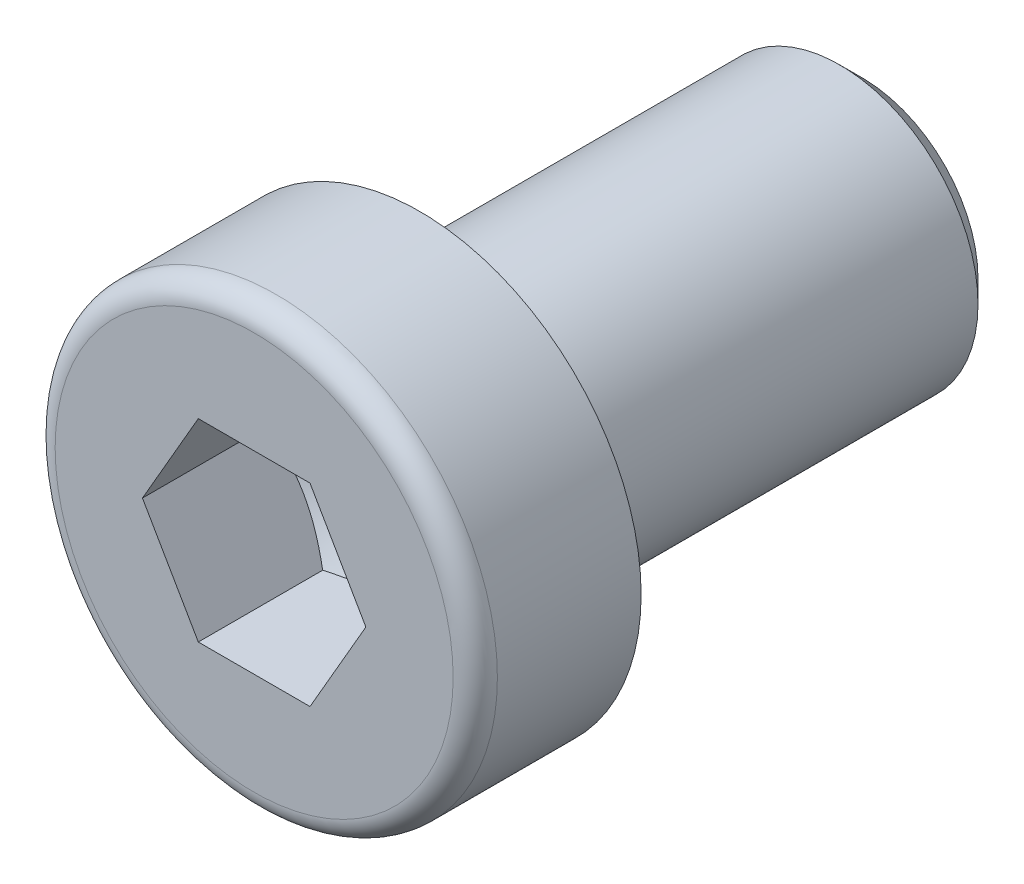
ISO-10303-21;
HEADER;
FILE_DESCRIPTION(('STEP AP214'),'2;1');
FILE_NAME('part.step','',(''),(''),'','','');
FILE_SCHEMA(('AUTOMOTIVE_DESIGN { 1 0 10303 214 1 1 1 1 }'));
ENDSEC;
DATA;
#1=APPLICATION_CONTEXT('core data for automotive mechanical design processes');
#2=APPLICATION_PROTOCOL_DEFINITION('international standard','automotive_design',2000,#1);
#3=PRODUCT_CONTEXT('',#1,'mechanical');
#4=PRODUCT('Part','Part','',(#3));
#5=PRODUCT_RELATED_PRODUCT_CATEGORY('part','',(#4));
#6=PRODUCT_DEFINITION_FORMATION('','',#4);
#7=PRODUCT_DEFINITION_CONTEXT('part definition',#1,'design');
#8=PRODUCT_DEFINITION('design','',#6,#7);
#9=PRODUCT_DEFINITION_SHAPE('','',#8);
#10=(LENGTH_UNIT() NAMED_UNIT(*) SI_UNIT(.MILLI.,.METRE.));
#11=(NAMED_UNIT(*) PLANE_ANGLE_UNIT() SI_UNIT($,.RADIAN.));
#12=(NAMED_UNIT(*) SI_UNIT($,.STERADIAN.) SOLID_ANGLE_UNIT());
#13=UNCERTAINTY_MEASURE_WITH_UNIT(LENGTH_MEASURE(1.E-05),#10,'distance_accuracy_value','');
#14=(GEOMETRIC_REPRESENTATION_CONTEXT(3) GLOBAL_UNCERTAINTY_ASSIGNED_CONTEXT((#13)) GLOBAL_UNIT_ASSIGNED_CONTEXT((#10,
#11,#12)) REPRESENTATION_CONTEXT('',''));
#15=CARTESIAN_POINT('',(0.,0.,0.));
#16=DIRECTION('',(0.,0.,1.));
#17=DIRECTION('',(1.,0.,0.));
#18=AXIS2_PLACEMENT_3D('',#15,#16,#17);
#19=CARTESIAN_POINT('',(0.,0.,6.));
#20=DIRECTION('',(0.,0.,1.));
#21=DIRECTION('',(1.,0.,0.));
#22=AXIS2_PLACEMENT_3D('',#19,#20,#21);
#23=PLANE('',#22);
#24=CARTESIAN_POINT('',(0.,0.,6.));
#25=DIRECTION('',(0.,0.,1.));
#26=DIRECTION('',(1.,0.,0.));
#27=AXIS2_PLACEMENT_3D('',#24,#25,#26);
#28=CIRCLE('',#27,7.2);
#29=CARTESIAN_POINT('',(7.2,0.,6.));
#30=VERTEX_POINT('',#29);
#31=EDGE_CURVE('E9',#30,#30,#28,.T.);
#32=ORIENTED_EDGE('',*,*,#31,.T.);
#33=EDGE_LOOP('',(#32));
#34=FACE_BOUND('',#33,.T.);
#35=DIRECTION('',(1.,0.,0.));
#36=VECTOR('',#35,1.);
#37=CARTESIAN_POINT('',(-2.020725,3.49999836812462,6.));
#38=LINE('',#37,#36);
#39=CARTESIAN_POINT('',(-2.020725,3.49999836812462,6.));
#40=VERTEX_POINT('',#39);
#41=CARTESIAN_POINT('',(2.020725,3.49999836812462,6.));
#42=VERTEX_POINT('',#41);
#43=EDGE_CURVE('E86',#40,#42,#38,.T.);
#44=ORIENTED_EDGE('',*,*,#43,.T.);
#45=DIRECTION('',(0.5,-0.866025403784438,0.));
#46=VECTOR('',#45,1.);
#47=CARTESIAN_POINT('',(2.020725,3.49999836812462,6.));
#48=LINE('',#47,#46);
#49=CARTESIAN_POINT('',(4.04145,0.,6.));
#50=VERTEX_POINT('',#49);
#51=EDGE_CURVE('E26',#42,#50,#48,.T.);
#52=ORIENTED_EDGE('',*,*,#51,.T.);
#53=DIRECTION('',(-0.5,-0.866025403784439,0.));
#54=VECTOR('',#53,1.);
#55=CARTESIAN_POINT('',(4.04145,0.,6.));
#56=LINE('',#55,#54);
#57=CARTESIAN_POINT('',(2.020725,-3.49999836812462,6.));
#58=VERTEX_POINT('',#57);
#59=EDGE_CURVE('E145',#50,#58,#56,.T.);
#60=ORIENTED_EDGE('',*,*,#59,.T.);
#61=DIRECTION('',(-1.,0.,0.));
#62=VECTOR('',#61,1.);
#63=CARTESIAN_POINT('',(2.020725,-3.49999836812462,6.));
#64=LINE('',#63,#62);
#65=CARTESIAN_POINT('',(-2.020725,-3.49999836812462,6.));
#66=VERTEX_POINT('',#65);
#67=EDGE_CURVE('E141',#58,#66,#64,.T.);
#68=ORIENTED_EDGE('',*,*,#67,.T.);
#69=DIRECTION('',(-0.5,0.866025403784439,0.));
#70=VECTOR('',#69,1.);
#71=CARTESIAN_POINT('',(-2.020725,-3.49999836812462,6.));
#72=LINE('',#71,#70);
#73=CARTESIAN_POINT('',(-4.04145,0.,6.));
#74=VERTEX_POINT('',#73);
#75=EDGE_CURVE('E136',#66,#74,#72,.T.);
#76=ORIENTED_EDGE('',*,*,#75,.T.);
#77=DIRECTION('',(0.5,0.866025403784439,0.));
#78=VECTOR('',#77,1.);
#79=CARTESIAN_POINT('',(-4.04145,0.,6.));
#80=LINE('',#79,#78);
#81=EDGE_CURVE('E90',#74,#40,#80,.T.);
#82=ORIENTED_EDGE('',*,*,#81,.T.);
#83=EDGE_LOOP('',(#44,#52,#60,#68,#76,#82));
#84=FACE_BOUND('',#83,.T.);
#85=ADVANCED_FACE('F12',(#34,#84),#23,.T.);
#86=CARTESIAN_POINT('',(0.,0.,5.2));
#87=DIRECTION('',(0.,0.,1.));
#88=DIRECTION('',(1.,0.,0.));
#89=AXIS2_PLACEMENT_3D('',#86,#87,#88);
#90=TOROIDAL_SURFACE('',#89,7.2,0.8);
#91=ORIENTED_EDGE('',*,*,#31,.F.);
#92=EDGE_LOOP('',(#91));
#93=FACE_BOUND('',#92,.T.);
#94=CARTESIAN_POINT('',(0.,0.,5.2));
#95=DIRECTION('',(0.,0.,1.));
#96=DIRECTION('',(1.,0.,0.));
#97=AXIS2_PLACEMENT_3D('',#94,#95,#96);
#98=CIRCLE('',#97,8.);
#99=CARTESIAN_POINT('',(8.,0.,5.2));
#100=VERTEX_POINT('',#99);
#101=EDGE_CURVE('E19',#100,#100,#98,.T.);
#102=ORIENTED_EDGE('',*,*,#101,.T.);
#103=EDGE_LOOP('',(#102));
#104=FACE_BOUND('',#103,.T.);
#105=ADVANCED_FACE('F118',(#93,#104),#90,.T.);
#106=CARTESIAN_POINT('',(0.,0.,6.));
#107=DIRECTION('',(0.,0.,1.));
#108=DIRECTION('',(1.,0.,0.));
#109=AXIS2_PLACEMENT_3D('',#106,#107,#108);
#110=CYLINDRICAL_SURFACE('',#109,8.);
#111=CARTESIAN_POINT('',(0.,0.,0.));
#112=DIRECTION('',(0.,0.,1.));
#113=DIRECTION('',(1.,0.,0.));
#114=AXIS2_PLACEMENT_3D('',#111,#112,#113);
#115=CIRCLE('',#114,8.);
#116=CARTESIAN_POINT('',(8.,0.,0.));
#117=VERTEX_POINT('',#116);
#118=EDGE_CURVE('E113',#117,#117,#115,.T.);
#119=ORIENTED_EDGE('',*,*,#118,.T.);
#120=EDGE_LOOP('',(#119));
#121=FACE_BOUND('',#120,.T.);
#122=ORIENTED_EDGE('',*,*,#101,.F.);
#123=EDGE_LOOP('',(#122));
#124=FACE_BOUND('',#123,.T.);
#125=ADVANCED_FACE('F120',(#121,#124),#110,.T.);
#126=CARTESIAN_POINT('',(0.,8.,0.));
#127=DIRECTION('',(0.,0.,-1.));
#128=DIRECTION('',(-1.,0.,0.));
#129=AXIS2_PLACEMENT_3D('',#126,#127,#128);
#130=PLANE('',#129);
#131=CARTESIAN_POINT('',(0.,0.,0.));
#132=DIRECTION('',(0.,0.,1.));
#133=DIRECTION('',(1.,0.,0.));
#134=AXIS2_PLACEMENT_3D('',#131,#132,#133);
#135=CIRCLE('',#134,5.5);
#136=CARTESIAN_POINT('',(5.5,0.,0.));
#137=VERTEX_POINT('',#136);
#138=EDGE_CURVE('E110',#137,#137,#135,.T.);
#139=ORIENTED_EDGE('',*,*,#138,.T.);
#140=EDGE_LOOP('',(#139));
#141=FACE_BOUND('',#140,.T.);
#142=ORIENTED_EDGE('',*,*,#118,.F.);
#143=EDGE_LOOP('',(#142));
#144=FACE_BOUND('',#143,.T.);
#145=ADVANCED_FACE('F121',(#141,#144),#130,.T.);
#146=CARTESIAN_POINT('',(0.,0.,-0.5));
#147=DIRECTION('',(0.,0.,1.));
#148=DIRECTION('',(1.,0.,0.));
#149=AXIS2_PLACEMENT_3D('',#146,#147,#148);
#150=TOROIDAL_SURFACE('',#149,5.5,0.5);
#151=CARTESIAN_POINT('',(0.,0.,-0.5));
#152=DIRECTION('',(0.,0.,1.));
#153=DIRECTION('',(1.,0.,0.));
#154=AXIS2_PLACEMENT_3D('',#151,#152,#153);
#155=CIRCLE('',#154,5.);
#156=CARTESIAN_POINT('',(5.,0.,-0.5));
#157=VERTEX_POINT('',#156);
#158=EDGE_CURVE('E107',#157,#157,#155,.T.);
#159=ORIENTED_EDGE('',*,*,#158,.T.);
#160=EDGE_LOOP('',(#159));
#161=FACE_BOUND('',#160,.T.);
#162=ORIENTED_EDGE('',*,*,#138,.F.);
#163=EDGE_LOOP('',(#162));
#164=FACE_BOUND('',#163,.T.);
#165=ADVANCED_FACE('F124',(#161,#164),#150,.F.);
#166=CARTESIAN_POINT('',(0.,0.,6.));
#167=DIRECTION('',(0.,0.,1.));
#168=DIRECTION('',(1.,0.,0.));
#169=AXIS2_PLACEMENT_3D('',#166,#167,#168);
#170=CYLINDRICAL_SURFACE('',#169,5.);
#171=CARTESIAN_POINT('',(0.,0.,-15.188125));
#172=DIRECTION('',(0.,0.,1.));
#173=DIRECTION('',(1.,0.,0.));
#174=AXIS2_PLACEMENT_3D('',#171,#172,#173);
#175=CIRCLE('',#174,5.);
#176=CARTESIAN_POINT('',(5.,0.,-15.188125));
#177=VERTEX_POINT('',#176);
#178=EDGE_CURVE('E104',#177,#177,#175,.T.);
#179=ORIENTED_EDGE('',*,*,#178,.T.);
#180=EDGE_LOOP('',(#179));
#181=FACE_BOUND('',#180,.T.);
#182=ORIENTED_EDGE('',*,*,#158,.F.);
#183=EDGE_LOOP('',(#182));
#184=FACE_BOUND('',#183,.T.);
#185=ADVANCED_FACE('F203',(#181,#184),#170,.T.);
#186=CARTESIAN_POINT('',(0.,0.,-15.188125));
#187=DIRECTION('',(0.,0.,1.));
#188=DIRECTION('',(1.,0.,0.));
#189=AXIS2_PLACEMENT_3D('',#186,#187,#188);
#190=CONICAL_SURFACE('',#189,5.,0.785398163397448);
#191=CARTESIAN_POINT('',(0.,0.,-16.));
#192=DIRECTION('',(0.,0.,1.));
#193=DIRECTION('',(1.,0.,0.));
#194=AXIS2_PLACEMENT_3D('',#191,#192,#193);
#195=CIRCLE('',#194,4.188125);
#196=CARTESIAN_POINT('',(4.188125,0.,-16.));
#197=VERTEX_POINT('',#196);
#198=EDGE_CURVE('E101',#197,#197,#195,.T.);
#199=ORIENTED_EDGE('',*,*,#198,.T.);
#200=EDGE_LOOP('',(#199));
#201=FACE_BOUND('',#200,.T.);
#202=ORIENTED_EDGE('',*,*,#178,.F.);
#203=EDGE_LOOP('',(#202));
#204=FACE_BOUND('',#203,.T.);
#205=ADVANCED_FACE('F201',(#201,#204),#190,.T.);
#206=CARTESIAN_POINT('',(0.,4.188125,-16.));
#207=DIRECTION('',(0.,0.,-1.));
#208=DIRECTION('',(-1.,0.,0.));
#209=AXIS2_PLACEMENT_3D('',#206,#207,#208);
#210=PLANE('',#209);
#211=ORIENTED_EDGE('',*,*,#198,.F.);
#212=EDGE_LOOP('',(#211));
#213=FACE_BOUND('',#212,.T.);
#214=ADVANCED_FACE('F196',(#213),#210,.T.);
#215=CARTESIAN_POINT('',(2.020725,3.49999836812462,-0.833332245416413));
#216=DIRECTION('',(-0.866025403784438,-0.5,0.));
#217=DIRECTION('',(-0.5,0.866025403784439,0.));
#218=AXIS2_PLACEMENT_3D('',#215,#216,#217);
#219=PLANE('',#218);
#220=DIRECTION('',(0.,0.,1.));
#221=VECTOR('',#220,1.);
#222=CARTESIAN_POINT('',(4.04145,0.,-0.833332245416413));
#223=LINE('',#222,#221);
#224=CARTESIAN_POINT('',(4.04145,0.,1.5));
#225=VERTEX_POINT('',#224);
#226=EDGE_CURVE('E99',#225,#50,#223,.T.);
#227=ORIENTED_EDGE('',*,*,#226,.T.);
#228=ORIENTED_EDGE('',*,*,#51,.F.);
#229=DIRECTION('',(0.,0.,1.));
#230=VECTOR('',#229,1.);
#231=CARTESIAN_POINT('',(2.020725,3.49999836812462,-0.833332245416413));
#232=LINE('',#231,#230);
#233=CARTESIAN_POINT('',(2.020725,3.49999836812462,1.5));
#234=VERTEX_POINT('',#233);
#235=EDGE_CURVE('E80',#234,#42,#232,.T.);
#236=ORIENTED_EDGE('',*,*,#235,.F.);
#237=CARTESIAN_POINT('',(4.04145011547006,-1.99999999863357E-07,1.50000006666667));
#238=CARTESIAN_POINT('',(3.95265148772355,0.153803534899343,1.44871728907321));
#239=CARTESIAN_POINT('',(3.8630863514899,0.308934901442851,1.40207828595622));
#240=CARTESIAN_POINT('',(3.68240531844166,0.62188363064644,1.32067130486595));
#241=CARTESIAN_POINT('',(3.59128621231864,0.779706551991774,1.28593212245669));
#242=CARTESIAN_POINT('',(3.41017719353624,1.09339657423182,1.23185807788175));
#243=CARTESIAN_POINT('',(3.32021513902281,1.24921542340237,1.21216328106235));
#244=CARTESIAN_POINT('',(3.13986794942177,1.56158591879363,1.18865619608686));
#245=CARTESIAN_POINT('',(3.04948346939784,1.71813643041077,1.18482443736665));
#246=CARTESIAN_POINT('',(2.88060974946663,2.01063429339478,1.19281614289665));
#247=CARTESIAN_POINT('',(2.80209516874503,2.14662553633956,1.20267737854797));
#248=CARTESIAN_POINT('',(2.64557750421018,2.41772208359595,1.23392539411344));
#249=CARTESIAN_POINT('',(2.56757496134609,2.55282645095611,1.25532283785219));
#250=CARTESIAN_POINT('',(2.41073485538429,2.82448148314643,1.3088123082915));
#251=CARTESIAN_POINT('',(2.33191713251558,2.96099778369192,1.34113096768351));
#252=CARTESIAN_POINT('',(2.17545691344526,3.23199483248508,1.41448066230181));
#253=CARTESIAN_POINT('',(2.09781241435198,3.36647904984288,1.45549447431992));
#254=CARTESIAN_POINT('',(2.02072488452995,3.49999856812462,1.50000006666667));
#255=B_SPLINE_CURVE_WITH_KNOTS('',3,(#237,#238,#239,#240,#241,#242,#243,#244,#245,#246,#247,
#248,#249,#250,#251,#252,#253,#254),.UNSPECIFIED.,.F.,.F.,(4,2,2,2,2,2,2,2,4),(0.,
0.55477777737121,1.11088869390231,1.65323758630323,2.19492059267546,2.66648753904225,
3.13849114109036,3.62096152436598,4.10248502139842),.UNSPECIFIED.);
#256=EDGE_CURVE('E73',#225,#234,#255,.T.);
#257=ORIENTED_EDGE('',*,*,#256,.F.);
#258=EDGE_LOOP('',(#227,#228,#236,#257));
#259=FACE_BOUND('',#258,.T.);
#260=ADVANCED_FACE('F81',(#259),#219,.T.);
#261=CARTESIAN_POINT('',(4.04145,0.,-0.833332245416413));
#262=DIRECTION('',(-0.866025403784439,0.5,0.));
#263=DIRECTION('',(0.5,0.866025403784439,0.));
#264=AXIS2_PLACEMENT_3D('',#261,#262,#263);
#265=PLANE('',#264);
#266=DIRECTION('',(0.,0.,1.));
#267=VECTOR('',#266,1.);
#268=CARTESIAN_POINT('',(2.020725,-3.49999836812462,-0.833332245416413));
#269=LINE('',#268,#267);
#270=CARTESIAN_POINT('',(2.020725,-3.49999836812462,1.5));
#271=VERTEX_POINT('',#270);
#272=EDGE_CURVE('E97',#271,#58,#269,.T.);
#273=ORIENTED_EDGE('',*,*,#272,.T.);
#274=ORIENTED_EDGE('',*,*,#59,.F.);
#275=ORIENTED_EDGE('',*,*,#226,.F.);
#276=CARTESIAN_POINT('',(2.02072488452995,-3.49999856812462,1.50000006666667));
#277=CARTESIAN_POINT('',(2.10952351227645,-3.34619483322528,1.44871728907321));
#278=CARTESIAN_POINT('',(2.1990886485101,-3.19106346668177,1.40207828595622));
#279=CARTESIAN_POINT('',(2.37976968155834,-2.87811473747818,1.32067130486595));
#280=CARTESIAN_POINT('',(2.47088878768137,-2.72029181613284,1.28593212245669));
#281=CARTESIAN_POINT('',(2.65199780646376,-2.4066017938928,1.23185807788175));
#282=CARTESIAN_POINT('',(2.74195986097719,-2.25078294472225,1.21216328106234));
#283=CARTESIAN_POINT('',(2.92230705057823,-1.93841244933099,1.18865619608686));
#284=CARTESIAN_POINT('',(3.01269153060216,-1.78186193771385,1.18482443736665));
#285=CARTESIAN_POINT('',(3.18156525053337,-1.48936407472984,1.19281614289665));
#286=CARTESIAN_POINT('',(3.26007983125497,-1.35337283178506,1.20267737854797));
#287=CARTESIAN_POINT('',(3.41659749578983,-1.08227628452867,1.23392539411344));
#288=CARTESIAN_POINT('',(3.49460003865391,-0.947171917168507,1.25532283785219));
#289=CARTESIAN_POINT('',(3.65144014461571,-0.675516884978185,1.3088123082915));
#290=CARTESIAN_POINT('',(3.73025786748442,-0.539000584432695,1.34113096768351));
#291=CARTESIAN_POINT('',(3.88671808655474,-0.268003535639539,1.41448066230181));
#292=CARTESIAN_POINT('',(3.96436258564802,-0.133519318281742,1.45549447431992));
#293=CARTESIAN_POINT('',(4.04145011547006,1.99999999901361E-07,1.50000006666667));
#294=B_SPLINE_CURVE_WITH_KNOTS('',3,(#276,#277,#278,#279,#280,#281,#282,#283,#284,#285,#286,
#287,#288,#289,#290,#291,#292,#293),.UNSPECIFIED.,.F.,.F.,(4,2,2,2,2,2,2,2,4),(0.,
0.554777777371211,1.11088869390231,1.65323758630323,2.19492059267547,2.66648753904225,
3.13849114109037,3.62096152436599,4.10248502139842),.UNSPECIFIED.);
#295=EDGE_CURVE('E77',#271,#225,#294,.T.);
#296=ORIENTED_EDGE('',*,*,#295,.F.);
#297=EDGE_LOOP('',(#273,#274,#275,#296));
#298=FACE_BOUND('',#297,.T.);
#299=ADVANCED_FACE('F191',(#298),#265,.T.);
#300=CARTESIAN_POINT('',(2.020725,-3.49999836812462,-0.833332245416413));
#301=DIRECTION('',(0.,1.,0.));
#302=DIRECTION('',(1.,0.,0.));
#303=AXIS2_PLACEMENT_3D('',#300,#301,#302);
#304=PLANE('',#303);
#305=DIRECTION('',(0.,0.,1.));
#306=VECTOR('',#305,1.);
#307=CARTESIAN_POINT('',(-2.020725,-3.49999836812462,-0.833332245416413));
#308=LINE('',#307,#306);
#309=CARTESIAN_POINT('',(-2.020725,-3.49999836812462,1.5));
#310=VERTEX_POINT('',#309);
#311=EDGE_CURVE('E95',#310,#66,#308,.T.);
#312=ORIENTED_EDGE('',*,*,#311,.T.);
#313=ORIENTED_EDGE('',*,*,#67,.F.);
#314=ORIENTED_EDGE('',*,*,#272,.F.);
#315=CARTESIAN_POINT('',(-5.23300548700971,-3.49999836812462,2.80142290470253));
#316=CARTESIAN_POINT('',(-5.08186350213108,-3.49999836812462,2.72891069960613));
#317=CARTESIAN_POINT('',(-4.93035331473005,-3.49999836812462,2.65715166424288));
#318=CARTESIAN_POINT('',(-4.62640029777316,-3.49999836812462,2.51556719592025));
#319=CARTESIAN_POINT('',(-4.47395730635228,-3.49999836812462,2.44574211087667));
#320=CARTESIAN_POINT('',(-4.16706837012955,-3.49999836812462,2.30806272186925));
#321=CARTESIAN_POINT('',(-4.01261588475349,-3.49999836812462,2.2402229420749));
#322=CARTESIAN_POINT('',(-3.70241484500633,-3.49999836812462,2.10758548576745));
#323=CARTESIAN_POINT('',(-3.54666635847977,-3.49999836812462,2.04278765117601));
#324=CARTESIAN_POINT('',(-3.2295228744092,-3.49999836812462,1.91539410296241));
#325=CARTESIAN_POINT('',(-3.06808671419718,-3.49999836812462,1.85290026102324));
#326=CARTESIAN_POINT('',(-2.74326171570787,-3.49999836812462,1.73310837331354));
#327=CARTESIAN_POINT('',(-2.57987265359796,-3.49999836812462,1.67581092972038));
#328=CARTESIAN_POINT('',(-2.25125204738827,-3.49999836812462,1.56804797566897));
#329=CARTESIAN_POINT('',(-2.08602564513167,-3.49999836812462,1.51756695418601));
#330=CARTESIAN_POINT('',(-1.75321943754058,-3.49999836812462,1.42517043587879));
#331=CARTESIAN_POINT('',(-1.58564044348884,-3.49999836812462,1.38325206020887));
#332=CARTESIAN_POINT('',(-1.24845647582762,-3.49999836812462,1.31020804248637));
#333=CARTESIAN_POINT('',(-1.07885629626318,-3.49999836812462,1.27906070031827));
#334=CARTESIAN_POINT('',(-0.737758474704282,-3.49999836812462,1.2296008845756));
#335=CARTESIAN_POINT('',(-0.566260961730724,-3.49999836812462,1.21128754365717));
#336=CARTESIAN_POINT('',(-0.224372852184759,-3.49999836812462,1.18919485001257));
#337=CARTESIAN_POINT('',(-0.0539936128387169,-3.49999836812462,1.18524398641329));
#338=CARTESIAN_POINT('',(0.286498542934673,-3.49999836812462,1.19177024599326));
#339=CARTESIAN_POINT('',(0.456611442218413,-3.49999836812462,1.2022482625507));
#340=CARTESIAN_POINT('',(0.751180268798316,-3.49999836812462,1.23217920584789));
#341=CARTESIAN_POINT('',(0.875961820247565,-3.49999836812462,1.24857504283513));
#342=CARTESIAN_POINT('',(1.12447979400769,-3.49999836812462,1.2880021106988));
#343=CARTESIAN_POINT('',(1.24821604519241,-3.49999836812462,1.3110344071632));
#344=CARTESIAN_POINT('',(1.61776103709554,-3.49999836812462,1.388860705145));
#345=CARTESIAN_POINT('',(1.86174857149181,-3.49999836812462,1.45236614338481));
#346=CARTESIAN_POINT('',(2.22655375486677,-3.49999836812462,1.56085221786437));
#347=CARTESIAN_POINT('',(2.34929477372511,-3.49999836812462,1.599719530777));
#348=CARTESIAN_POINT('',(2.59358315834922,-3.49999836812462,1.68107312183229));
#349=CARTESIAN_POINT('',(2.71513051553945,-3.49999836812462,1.72355942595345));
#350=CARTESIAN_POINT('',(2.95708016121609,-3.49999836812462,1.81150426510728));
#351=CARTESIAN_POINT('',(3.07748289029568,-3.49999836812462,1.85696159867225));
#352=CARTESIAN_POINT('',(3.31731786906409,-3.49999836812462,1.95035573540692));
#353=CARTESIAN_POINT('',(3.43675013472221,-3.49999836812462,1.99829249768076));
#354=CARTESIAN_POINT('',(3.74161531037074,-3.49999836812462,2.12372899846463));
#355=CARTESIAN_POINT('',(3.92643815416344,-3.49999836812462,2.20270955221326));
#356=CARTESIAN_POINT('',(4.29441871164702,-3.49999836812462,2.3644701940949));
#357=CARTESIAN_POINT('',(4.47757629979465,-3.49999836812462,2.44725056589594));
#358=CARTESIAN_POINT('',(4.84258250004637,-3.49999836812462,2.61575344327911));
#359=CARTESIAN_POINT('',(5.02443078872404,-3.49999836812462,2.70147664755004));
#360=CARTESIAN_POINT('',(5.38703214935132,-3.49999836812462,2.87521247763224));
#361=CARTESIAN_POINT('',(5.56778519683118,-3.49999836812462,2.96322515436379));
#362=CARTESIAN_POINT('',(6.10913813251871,-3.49999836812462,3.23016579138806));
#363=CARTESIAN_POINT('',(6.46840426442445,-3.49999836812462,3.41179602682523));
#364=CARTESIAN_POINT('',(7.18447053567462,-3.49999836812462,3.77969851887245));
#365=CARTESIAN_POINT('',(7.54127102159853,-3.49999836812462,3.96597010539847));
#366=CARTESIAN_POINT('',(8.21957335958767,-3.49999836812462,4.32400431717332));
#367=CARTESIAN_POINT('',(8.54122846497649,-3.49999836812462,4.49547706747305));
#368=CARTESIAN_POINT('',(9.18350585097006,-3.49999836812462,4.84037574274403));
#369=CARTESIAN_POINT('',(9.50412808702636,-3.49999836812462,5.01380175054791));
#370=CARTESIAN_POINT('',(10.1437608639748,-3.49999836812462,5.36167496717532));
#371=CARTESIAN_POINT('',(10.462773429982,-3.49999836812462,5.53611845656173));
#372=CARTESIAN_POINT('',(11.1001518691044,-3.49999836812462,5.88613987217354));
#373=CARTESIAN_POINT('',(11.4185177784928,-3.49999836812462,6.06171773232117));
#374=CARTESIAN_POINT('',(11.7366519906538,-3.49999836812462,6.23771172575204));
#375=B_SPLINE_CURVE_WITH_KNOTS('',3,(#315,#316,#317,#318,#319,#320,#321,#322,#323,#324,#325,
#326,#327,#328,#329,#330,#331,#332,#333,#334,#335,#336,#337,#338,#339,#340,#341,#342,#343,#344,
#345,#346,#347,#348,#349,#350,#351,#352,#353,#354,#355,#356,#357,#358,#359,#360,#361,#362,#363,
#364,#365,#366,#367,#368,#369,#370,#371,#372,#373,#374),.UNSPECIFIED.,.F.,.F.,(4,2,2,2,2,2,2,2,
2,2,2,2,2,2,2,2,2,2,2,2,2,2,2,2,2,2,2,2,2,4),(0.,0.502915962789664,1.00592181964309,
1.5119789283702,2.01800971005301,2.53727102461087,3.0565924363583,3.57471144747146,
4.09265597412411,4.609550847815,5.12641078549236,5.63707793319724,6.14777670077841,
6.52515250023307,6.90258892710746,7.65793508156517,8.04415160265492,8.43037089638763,
8.81643496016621,9.20249265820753,9.80540420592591,10.4083608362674,11.0114616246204,
11.6145758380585,12.8222204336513,14.0296916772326,15.123201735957,16.2167583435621,
17.3075334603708,18.3982456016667),.UNSPECIFIED.);
#376=EDGE_CURVE('E183',#310,#271,#375,.T.);
#377=ORIENTED_EDGE('',*,*,#376,.F.);
#378=EDGE_LOOP('',(#312,#313,#314,#377));
#379=FACE_BOUND('',#378,.T.);
#380=ADVANCED_FACE('F188',(#379),#304,.T.);
#381=CARTESIAN_POINT('',(-2.020725,-3.49999836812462,-0.833332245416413));
#382=DIRECTION('',(0.866025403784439,0.5,0.));
#383=DIRECTION('',(0.5,-0.866025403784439,0.));
#384=AXIS2_PLACEMENT_3D('',#381,#382,#383);
#385=PLANE('',#384);
#386=DIRECTION('',(0.,0.,1.));
#387=VECTOR('',#386,1.);
#388=CARTESIAN_POINT('',(-4.04145,0.,-0.833332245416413));
#389=LINE('',#388,#387);
#390=CARTESIAN_POINT('',(-4.04145,0.,1.5));
#391=VERTEX_POINT('',#390);
#392=EDGE_CURVE('E88',#391,#74,#389,.T.);
#393=ORIENTED_EDGE('',*,*,#392,.T.);
#394=ORIENTED_EDGE('',*,*,#75,.F.);
#395=ORIENTED_EDGE('',*,*,#311,.F.);
#396=CARTESIAN_POINT('',(-4.04145011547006,2.00000000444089E-07,1.50000006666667));
#397=CARTESIAN_POINT('',(-3.95265148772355,-0.153803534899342,1.44871728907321));
#398=CARTESIAN_POINT('',(-3.8630863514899,-0.308934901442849,1.40207828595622));
#399=CARTESIAN_POINT('',(-3.68240531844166,-0.621883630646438,1.32067130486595));
#400=CARTESIAN_POINT('',(-3.59128621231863,-0.779706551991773,1.28593212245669));
#401=CARTESIAN_POINT('',(-3.41017719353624,-1.09339657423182,1.23185807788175));
#402=CARTESIAN_POINT('',(-3.32021513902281,-1.24921542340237,1.21216328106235));
#403=CARTESIAN_POINT('',(-3.13986794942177,-1.56158591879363,1.18865619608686));
#404=CARTESIAN_POINT('',(-3.04948346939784,-1.71813643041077,1.18482443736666));
#405=CARTESIAN_POINT('',(-2.88060974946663,-2.01063429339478,1.19281614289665));
#406=CARTESIAN_POINT('',(-2.80209516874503,-2.14662553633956,1.20267737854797));
#407=CARTESIAN_POINT('',(-2.64557750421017,-2.41772208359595,1.23392539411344));
#408=CARTESIAN_POINT('',(-2.56757496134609,-2.55282645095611,1.25532283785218));
#409=CARTESIAN_POINT('',(-2.41073485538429,-2.82448148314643,1.3088123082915));
#410=CARTESIAN_POINT('',(-2.33191713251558,-2.96099778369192,1.34113096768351));
#411=CARTESIAN_POINT('',(-2.17545691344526,-3.23199483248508,1.41448066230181));
#412=CARTESIAN_POINT('',(-2.09781241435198,-3.36647904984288,1.45549447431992));
#413=CARTESIAN_POINT('',(-2.02072488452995,-3.49999856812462,1.50000006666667));
#414=B_SPLINE_CURVE_WITH_KNOTS('',3,(#396,#397,#398,#399,#400,#401,#402,#403,#404,#405,#406,
#407,#408,#409,#410,#411,#412,#413),.UNSPECIFIED.,.F.,.F.,(4,2,2,2,2,2,2,2,4),(0.,
0.55477777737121,1.11088869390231,1.65323758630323,2.19492059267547,2.66648753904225,
3.13849114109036,3.62096152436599,4.10248502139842),.UNSPECIFIED.);
#415=EDGE_CURVE('E178',#391,#310,#414,.T.);
#416=ORIENTED_EDGE('',*,*,#415,.F.);
#417=EDGE_LOOP('',(#393,#394,#395,#416));
#418=FACE_BOUND('',#417,.T.);
#419=ADVANCED_FACE('F190',(#418),#385,.T.);
#420=CARTESIAN_POINT('',(-4.04145,0.,-0.833332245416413));
#421=DIRECTION('',(0.866025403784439,-0.5,0.));
#422=DIRECTION('',(-0.5,-0.866025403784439,0.));
#423=AXIS2_PLACEMENT_3D('',#420,#421,#422);
#424=PLANE('',#423);
#425=DIRECTION('',(0.,0.,1.));
#426=VECTOR('',#425,1.);
#427=CARTESIAN_POINT('',(-2.020725,3.49999836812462,-0.833332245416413));
#428=LINE('',#427,#426);
#429=CARTESIAN_POINT('',(-2.020725,3.49999836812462,1.5));
#430=VERTEX_POINT('',#429);
#431=EDGE_CURVE('E85',#430,#40,#428,.T.);
#432=ORIENTED_EDGE('',*,*,#431,.T.);
#433=ORIENTED_EDGE('',*,*,#81,.F.);
#434=ORIENTED_EDGE('',*,*,#392,.F.);
#435=CARTESIAN_POINT('',(-2.02072488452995,3.49999856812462,1.50000006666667));
#436=CARTESIAN_POINT('',(-2.10952351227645,3.34619483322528,1.44871728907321));
#437=CARTESIAN_POINT('',(-2.1990886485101,3.19106346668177,1.40207828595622));
#438=CARTESIAN_POINT('',(-2.37976968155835,2.87811473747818,1.32067130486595));
#439=CARTESIAN_POINT('',(-2.47088878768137,2.72029181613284,1.28593212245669));
#440=CARTESIAN_POINT('',(-2.65199780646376,2.4066017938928,1.23185807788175));
#441=CARTESIAN_POINT('',(-2.74195986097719,2.25078294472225,1.21216328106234));
#442=CARTESIAN_POINT('',(-2.92230705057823,1.93841244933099,1.18865619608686));
#443=CARTESIAN_POINT('',(-3.01269153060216,1.78186193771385,1.18482443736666));
#444=CARTESIAN_POINT('',(-3.18156525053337,1.48936407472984,1.19281614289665));
#445=CARTESIAN_POINT('',(-3.26007983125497,1.35337283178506,1.20267737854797));
#446=CARTESIAN_POINT('',(-3.41659749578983,1.08227628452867,1.23392539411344));
#447=CARTESIAN_POINT('',(-3.49460003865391,0.947171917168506,1.25532283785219));
#448=CARTESIAN_POINT('',(-3.65144014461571,0.675516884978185,1.3088123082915));
#449=CARTESIAN_POINT('',(-3.73025786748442,0.539000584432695,1.34113096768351));
#450=CARTESIAN_POINT('',(-3.88671808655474,0.26800353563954,1.41448066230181));
#451=CARTESIAN_POINT('',(-3.96436258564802,0.133519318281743,1.45549447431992));
#452=CARTESIAN_POINT('',(-4.04145011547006,-1.99999999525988E-07,1.50000006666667));
#453=B_SPLINE_CURVE_WITH_KNOTS('',3,(#435,#436,#437,#438,#439,#440,#441,#442,#443,#444,#445,
#446,#447,#448,#449,#450,#451,#452),.UNSPECIFIED.,.F.,.F.,(4,2,2,2,2,2,2,2,4),(0.,
0.554777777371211,1.11088869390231,1.65323758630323,2.19492059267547,2.66648753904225,
3.13849114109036,3.62096152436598,4.10248502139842),.UNSPECIFIED.);
#454=EDGE_CURVE('E34',#430,#391,#453,.T.);
#455=ORIENTED_EDGE('',*,*,#454,.F.);
#456=EDGE_LOOP('',(#432,#433,#434,#455));
#457=FACE_BOUND('',#456,.T.);
#458=ADVANCED_FACE('F135',(#457),#424,.T.);
#459=CARTESIAN_POINT('',(-2.020725,3.49999836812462,-0.833332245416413));
#460=DIRECTION('',(0.,-1.,0.));
#461=DIRECTION('',(-1.,0.,0.));
#462=AXIS2_PLACEMENT_3D('',#459,#460,#461);
#463=PLANE('',#462);
#464=ORIENTED_EDGE('',*,*,#235,.T.);
#465=ORIENTED_EDGE('',*,*,#43,.F.);
#466=ORIENTED_EDGE('',*,*,#431,.F.);
#467=CARTESIAN_POINT('',(-5.23300548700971,3.49999836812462,2.80142290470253));
#468=CARTESIAN_POINT('',(-5.08186350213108,3.49999836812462,2.72891069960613));
#469=CARTESIAN_POINT('',(-4.93035331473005,3.49999836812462,2.65715166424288));
#470=CARTESIAN_POINT('',(-4.62640029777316,3.49999836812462,2.51556719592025));
#471=CARTESIAN_POINT('',(-4.47395730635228,3.49999836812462,2.44574211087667));
#472=CARTESIAN_POINT('',(-4.16706837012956,3.49999836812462,2.30806272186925));
#473=CARTESIAN_POINT('',(-4.01261588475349,3.49999836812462,2.2402229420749));
#474=CARTESIAN_POINT('',(-3.70241484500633,3.49999836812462,2.10758548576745));
#475=CARTESIAN_POINT('',(-3.54666635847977,3.49999836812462,2.04278765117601));
#476=CARTESIAN_POINT('',(-3.2295228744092,3.49999836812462,1.91539410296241));
#477=CARTESIAN_POINT('',(-3.06808671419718,3.49999836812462,1.85290026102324));
#478=CARTESIAN_POINT('',(-2.74326171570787,3.49999836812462,1.73310837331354));
#479=CARTESIAN_POINT('',(-2.57987265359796,3.49999836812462,1.67581092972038));
#480=CARTESIAN_POINT('',(-2.25125204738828,3.49999836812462,1.56804797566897));
#481=CARTESIAN_POINT('',(-2.08602564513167,3.49999836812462,1.51756695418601));
#482=CARTESIAN_POINT('',(-1.75321943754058,3.49999836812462,1.42517043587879));
#483=CARTESIAN_POINT('',(-1.58564044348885,3.49999836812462,1.38325206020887));
#484=CARTESIAN_POINT('',(-1.24845647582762,3.49999836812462,1.31020804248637));
#485=CARTESIAN_POINT('',(-1.07885629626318,3.49999836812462,1.27906070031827));
#486=CARTESIAN_POINT('',(-0.737758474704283,3.49999836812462,1.2296008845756));
#487=CARTESIAN_POINT('',(-0.566260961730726,3.49999836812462,1.21128754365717));
#488=CARTESIAN_POINT('',(-0.224372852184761,3.49999836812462,1.18919485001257));
#489=CARTESIAN_POINT('',(-0.053993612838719,3.49999836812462,1.18524398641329));
#490=CARTESIAN_POINT('',(0.286498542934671,3.49999836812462,1.19177024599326));
#491=CARTESIAN_POINT('',(0.456611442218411,3.49999836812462,1.2022482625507));
#492=CARTESIAN_POINT('',(0.751180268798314,3.49999836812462,1.23217920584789));
#493=CARTESIAN_POINT('',(0.875961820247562,3.49999836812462,1.24857504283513));
#494=CARTESIAN_POINT('',(1.12447979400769,3.49999836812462,1.2880021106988));
#495=CARTESIAN_POINT('',(1.24821604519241,3.49999836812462,1.3110344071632));
#496=CARTESIAN_POINT('',(1.61776103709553,3.49999836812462,1.388860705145));
#497=CARTESIAN_POINT('',(1.86174857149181,3.49999836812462,1.45236614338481));
#498=CARTESIAN_POINT('',(2.22655375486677,3.49999836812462,1.56085221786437));
#499=CARTESIAN_POINT('',(2.34929477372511,3.49999836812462,1.599719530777));
#500=CARTESIAN_POINT('',(2.59358315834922,3.49999836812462,1.68107312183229));
#501=CARTESIAN_POINT('',(2.71513051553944,3.49999836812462,1.72355942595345));
#502=CARTESIAN_POINT('',(2.95708016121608,3.49999836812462,1.81150426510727));
#503=CARTESIAN_POINT('',(3.07748289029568,3.49999836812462,1.85696159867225));
#504=CARTESIAN_POINT('',(3.31731786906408,3.49999836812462,1.95035573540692));
#505=CARTESIAN_POINT('',(3.43675013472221,3.49999836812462,1.99829249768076));
#506=CARTESIAN_POINT('',(3.74161531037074,3.49999836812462,2.12372899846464));
#507=CARTESIAN_POINT('',(3.92643815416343,3.49999836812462,2.20270955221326));
#508=CARTESIAN_POINT('',(4.29441871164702,3.49999836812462,2.3644701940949));
#509=CARTESIAN_POINT('',(4.47757629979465,3.49999836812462,2.44725056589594));
#510=CARTESIAN_POINT('',(4.84258250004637,3.49999836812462,2.61575344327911));
#511=CARTESIAN_POINT('',(5.02443078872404,3.49999836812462,2.70147664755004));
#512=CARTESIAN_POINT('',(5.38703214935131,3.49999836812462,2.87521247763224));
#513=CARTESIAN_POINT('',(5.56778519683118,3.49999836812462,2.96322515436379));
#514=CARTESIAN_POINT('',(6.1091381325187,3.49999836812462,3.23016579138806));
#515=CARTESIAN_POINT('',(6.46840426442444,3.49999836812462,3.41179602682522));
#516=CARTESIAN_POINT('',(7.18447053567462,3.49999836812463,3.77969851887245));
#517=CARTESIAN_POINT('',(7.54127102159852,3.49999836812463,3.96597010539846));
#518=CARTESIAN_POINT('',(8.21957335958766,3.49999836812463,4.32400431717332));
#519=CARTESIAN_POINT('',(8.54122846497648,3.49999836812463,4.49547706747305));
#520=CARTESIAN_POINT('',(9.18350585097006,3.49999836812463,4.84037574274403));
#521=CARTESIAN_POINT('',(9.50412808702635,3.49999836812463,5.01380175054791));
#522=CARTESIAN_POINT('',(10.1437608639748,3.49999836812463,5.36167496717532));
#523=CARTESIAN_POINT('',(10.462773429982,3.49999836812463,5.53611845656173));
#524=CARTESIAN_POINT('',(11.1001518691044,3.49999836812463,5.88613987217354));
#525=CARTESIAN_POINT('',(11.4185177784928,3.49999836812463,6.06171773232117));
#526=CARTESIAN_POINT('',(11.7366519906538,3.49999836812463,6.23771172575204));
#527=B_SPLINE_CURVE_WITH_KNOTS('',3,(#467,#468,#469,#470,#471,#472,#473,#474,#475,#476,#477,
#478,#479,#480,#481,#482,#483,#484,#485,#486,#487,#488,#489,#490,#491,#492,#493,#494,#495,#496,
#497,#498,#499,#500,#501,#502,#503,#504,#505,#506,#507,#508,#509,#510,#511,#512,#513,#514,#515,
#516,#517,#518,#519,#520,#521,#522,#523,#524,#525,#526),.UNSPECIFIED.,.F.,.F.,(4,2,2,2,2,2,2,2,
2,2,2,2,2,2,2,2,2,2,2,2,2,2,2,2,2,2,2,2,2,4),(0.,0.502915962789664,1.00592181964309,
1.5119789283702,2.01800971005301,2.53727102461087,3.0565924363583,3.57471144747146,
4.09265597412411,4.609550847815,5.12641078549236,5.63707793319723,6.14777670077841,
6.52515250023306,6.90258892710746,7.65793508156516,8.04415160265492,8.43037089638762,
8.8164349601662,9.20249265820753,9.80540420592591,10.4083608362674,11.0114616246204,
11.6145758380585,12.8222204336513,14.0296916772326,15.123201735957,16.2167583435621,
17.3075334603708,18.3982456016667),.UNSPECIFIED.);
#528=EDGE_CURVE('E74',#234,#430,#527,.F.);
#529=ORIENTED_EDGE('',*,*,#528,.F.);
#530=EDGE_LOOP('',(#464,#465,#466,#529));
#531=FACE_BOUND('',#530,.T.);
#532=ADVANCED_FACE('F69',(#531),#463,.T.);
#533=CARTESIAN_POINT('',(0.,0.,-0.833332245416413));
#534=DIRECTION('',(0.,0.,1.));
#535=DIRECTION('',(1.,0.,0.));
#536=AXIS2_PLACEMENT_3D('',#533,#534,#535);
#537=CONICAL_SURFACE('',#536,0.,1.0471975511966);
#538=CARTESIAN_POINT('',(0.,0.,-0.833332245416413));
#539=VERTEX_POINT('',#538);
#540=VERTEX_LOOP('',#539);
#541=FACE_BOUND('',#540,.T.);
#542=ORIENTED_EDGE('',*,*,#256,.T.);
#543=ORIENTED_EDGE('',*,*,#528,.T.);
#544=ORIENTED_EDGE('',*,*,#454,.T.);
#545=ORIENTED_EDGE('',*,*,#415,.T.);
#546=ORIENTED_EDGE('',*,*,#376,.T.);
#547=ORIENTED_EDGE('',*,*,#295,.T.);
#548=EDGE_LOOP('',(#542,#543,#544,#545,#546,#547));
#549=FACE_BOUND('',#548,.T.);
#550=ADVANCED_FACE('F67',(#541,#549),#537,.F.);
#551=CLOSED_SHELL('',(#85,#105,#125,#145,#165,#185,#205,#214,#260,#299,#380,#419,#458,#532,#550));
#552=MANIFOLD_SOLID_BREP('B1',#551);
#553=ADVANCED_BREP_SHAPE_REPRESENTATION('',(#18,#552),#14);
#554=SHAPE_DEFINITION_REPRESENTATION(#9,#553);
ENDSEC;
END-ISO-10303-21;
